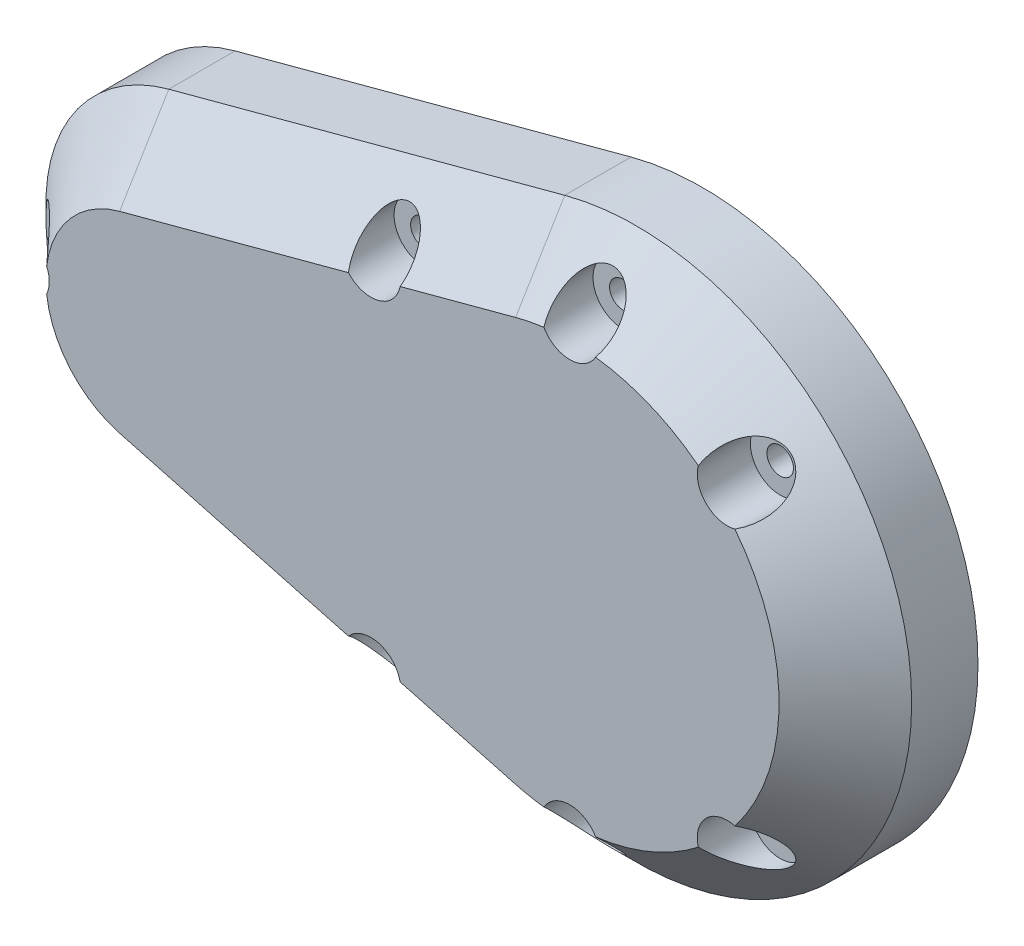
ISO-10303-21;
HEADER;
FILE_DESCRIPTION(('STEP AP214'),'2;1');
FILE_NAME('part.step','',(''),(''),'','','');
FILE_SCHEMA(('AUTOMOTIVE_DESIGN { 1 0 10303 214 1 1 1 1 }'));
ENDSEC;
DATA;
#1=APPLICATION_CONTEXT('core data for automotive mechanical design processes');
#2=APPLICATION_PROTOCOL_DEFINITION('international standard','automotive_design',2000,#1);
#3=PRODUCT_CONTEXT('',#1,'mechanical');
#4=PRODUCT('Part','Part','',(#3));
#5=PRODUCT_RELATED_PRODUCT_CATEGORY('part','',(#4));
#6=PRODUCT_DEFINITION_FORMATION('','',#4);
#7=PRODUCT_DEFINITION_CONTEXT('part definition',#1,'design');
#8=PRODUCT_DEFINITION('design','',#6,#7);
#9=PRODUCT_DEFINITION_SHAPE('','',#8);
#10=(LENGTH_UNIT() NAMED_UNIT(*) SI_UNIT(.MILLI.,.METRE.));
#11=(NAMED_UNIT(*) PLANE_ANGLE_UNIT() SI_UNIT($,.RADIAN.));
#12=(NAMED_UNIT(*) SI_UNIT($,.STERADIAN.) SOLID_ANGLE_UNIT());
#13=UNCERTAINTY_MEASURE_WITH_UNIT(LENGTH_MEASURE(1.E-05),#10,'distance_accuracy_value','');
#14=(GEOMETRIC_REPRESENTATION_CONTEXT(3) GLOBAL_UNCERTAINTY_ASSIGNED_CONTEXT((#13)) GLOBAL_UNIT_ASSIGNED_CONTEXT((#10,
#11,#12)) REPRESENTATION_CONTEXT('',''));
#15=CARTESIAN_POINT('',(0.,0.,0.));
#16=DIRECTION('',(0.,0.,1.));
#17=DIRECTION('',(1.,0.,0.));
#18=AXIS2_PLACEMENT_3D('',#15,#16,#17);
#19=CARTESIAN_POINT('',(-3.40000000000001,-13.3549838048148,10.));
#20=DIRECTION('',(0.,0.,-1.));
#21=DIRECTION('',(-1.,0.,0.));
#22=AXIS2_PLACEMENT_3D('',#19,#20,#21);
#23=CYLINDRICAL_SURFACE('',#22,0.999999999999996);
#24=CARTESIAN_POINT('',(-3.40000000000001,-13.3549838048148,0.));
#25=DIRECTION('',(0.,0.,-1.));
#26=DIRECTION('',(-1.,0.,0.));
#27=AXIS2_PLACEMENT_3D('',#24,#25,#26);
#28=CIRCLE('',#27,0.999999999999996);
#29=CARTESIAN_POINT('',(-4.40000000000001,-13.3549838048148,0.));
#30=VERTEX_POINT('',#29);
#31=EDGE_CURVE('E206',#30,#30,#28,.T.);
#32=ORIENTED_EDGE('',*,*,#31,.T.);
#33=EDGE_LOOP('',(#32));
#34=FACE_BOUND('',#33,.T.);
#35=CARTESIAN_POINT('',(-3.40000000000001,-13.3549838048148,6.));
#36=DIRECTION('',(0.,0.,1.));
#37=DIRECTION('',(1.,0.,0.));
#38=AXIS2_PLACEMENT_3D('',#35,#36,#37);
#39=CIRCLE('',#38,0.999999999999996);
#40=CARTESIAN_POINT('',(-2.40000000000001,-13.3549838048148,6.));
#41=VERTEX_POINT('',#40);
#42=EDGE_CURVE('E233',#41,#41,#39,.F.);
#43=ORIENTED_EDGE('',*,*,#42,.F.);
#44=EDGE_LOOP('',(#43));
#45=FACE_BOUND('',#44,.T.);
#46=ADVANCED_FACE('F59',(#34,#45),#23,.F.);
#47=CARTESIAN_POINT('',(23.4668141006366,11.8668141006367,10.));
#48=DIRECTION('',(0.,0.,-1.));
#49=DIRECTION('',(-1.,0.,0.));
#50=AXIS2_PLACEMENT_3D('',#47,#48,#49);
#51=CYLINDRICAL_SURFACE('',#50,0.999999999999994);
#52=CARTESIAN_POINT('',(23.4668141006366,11.8668141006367,0.));
#53=DIRECTION('',(0.,0.,-1.));
#54=DIRECTION('',(-1.,0.,0.));
#55=AXIS2_PLACEMENT_3D('',#52,#53,#54);
#56=CIRCLE('',#55,0.999999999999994);
#57=CARTESIAN_POINT('',(22.4668141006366,11.8668141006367,0.));
#58=VERTEX_POINT('',#57);
#59=EDGE_CURVE('E448',#58,#58,#56,.T.);
#60=ORIENTED_EDGE('',*,*,#59,.T.);
#61=EDGE_LOOP('',(#60));
#62=FACE_BOUND('',#61,.T.);
#63=CARTESIAN_POINT('',(23.4668141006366,11.8668141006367,6.));
#64=DIRECTION('',(0.,0.,1.));
#65=DIRECTION('',(1.,0.,0.));
#66=AXIS2_PLACEMENT_3D('',#63,#64,#65);
#67=CIRCLE('',#66,0.999999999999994);
#68=CARTESIAN_POINT('',(24.4668141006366,11.8668141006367,6.));
#69=VERTEX_POINT('',#68);
#70=EDGE_CURVE('E230',#69,#69,#67,.F.);
#71=ORIENTED_EDGE('',*,*,#70,.F.);
#72=EDGE_LOOP('',(#71));
#73=FACE_BOUND('',#72,.T.);
#74=ADVANCED_FACE('F343',(#62,#73),#51,.F.);
#75=CARTESIAN_POINT('',(11.6000000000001,16.7822094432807,10.));
#76=DIRECTION('',(0.,0.,-1.));
#77=DIRECTION('',(-1.,0.,0.));
#78=AXIS2_PLACEMENT_3D('',#75,#76,#77);
#79=CYLINDRICAL_SURFACE('',#78,1.);
#80=CARTESIAN_POINT('',(11.6000000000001,16.7822094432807,0.));
#81=DIRECTION('',(0.,0.,-1.));
#82=DIRECTION('',(-1.,0.,0.));
#83=AXIS2_PLACEMENT_3D('',#80,#81,#82);
#84=CIRCLE('',#83,1.);
#85=CARTESIAN_POINT('',(10.6000000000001,16.7822094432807,0.));
#86=VERTEX_POINT('',#85);
#87=EDGE_CURVE('E449',#86,#86,#84,.T.);
#88=ORIENTED_EDGE('',*,*,#87,.T.);
#89=EDGE_LOOP('',(#88));
#90=FACE_BOUND('',#89,.T.);
#91=CARTESIAN_POINT('',(11.6000000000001,16.7822094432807,6.));
#92=DIRECTION('',(0.,0.,1.));
#93=DIRECTION('',(1.,0.,0.));
#94=AXIS2_PLACEMENT_3D('',#91,#92,#93);
#95=CIRCLE('',#94,1.);
#96=CARTESIAN_POINT('',(12.6000000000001,16.7822094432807,6.));
#97=VERTEX_POINT('',#96);
#98=EDGE_CURVE('E227',#97,#97,#95,.F.);
#99=ORIENTED_EDGE('',*,*,#98,.F.);
#100=EDGE_LOOP('',(#99));
#101=FACE_BOUND('',#100,.T.);
#102=ADVANCED_FACE('F349',(#90,#101),#79,.F.);
#103=CARTESIAN_POINT('',(23.4668141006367,-11.8668141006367,10.));
#104=DIRECTION('',(0.,0.,-1.));
#105=DIRECTION('',(-1.,0.,0.));
#106=AXIS2_PLACEMENT_3D('',#103,#104,#105);
#107=CYLINDRICAL_SURFACE('',#106,1.);
#108=CARTESIAN_POINT('',(23.4668141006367,-11.8668141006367,0.));
#109=DIRECTION('',(0.,0.,-1.));
#110=DIRECTION('',(-1.,0.,0.));
#111=AXIS2_PLACEMENT_3D('',#108,#109,#110);
#112=CIRCLE('',#111,1.);
#113=CARTESIAN_POINT('',(22.4668141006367,-11.8668141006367,0.));
#114=VERTEX_POINT('',#113);
#115=EDGE_CURVE('E445',#114,#114,#112,.T.);
#116=ORIENTED_EDGE('',*,*,#115,.T.);
#117=EDGE_LOOP('',(#116));
#118=FACE_BOUND('',#117,.T.);
#119=CARTESIAN_POINT('',(23.4668141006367,-11.8668141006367,6.));
#120=DIRECTION('',(0.,0.,1.));
#121=DIRECTION('',(1.,0.,0.));
#122=AXIS2_PLACEMENT_3D('',#119,#120,#121);
#123=CIRCLE('',#122,1.);
#124=CARTESIAN_POINT('',(24.4668141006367,-11.8668141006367,6.));
#125=VERTEX_POINT('',#124);
#126=EDGE_CURVE('E224',#125,#125,#123,.F.);
#127=ORIENTED_EDGE('',*,*,#126,.F.);
#128=EDGE_LOOP('',(#127));
#129=FACE_BOUND('',#128,.T.);
#130=ADVANCED_FACE('F490',(#118,#129),#107,.F.);
#131=CARTESIAN_POINT('',(11.6,-16.7822094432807,10.));
#132=DIRECTION('',(0.,0.,-1.));
#133=DIRECTION('',(-1.,0.,0.));
#134=AXIS2_PLACEMENT_3D('',#131,#132,#133);
#135=CYLINDRICAL_SURFACE('',#134,1.);
#136=CARTESIAN_POINT('',(11.6,-16.7822094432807,0.));
#137=DIRECTION('',(0.,0.,-1.));
#138=DIRECTION('',(-1.,0.,0.));
#139=AXIS2_PLACEMENT_3D('',#136,#137,#138);
#140=CIRCLE('',#139,1.);
#141=CARTESIAN_POINT('',(10.6,-16.7822094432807,0.));
#142=VERTEX_POINT('',#141);
#143=EDGE_CURVE('E236',#142,#142,#140,.T.);
#144=ORIENTED_EDGE('',*,*,#143,.T.);
#145=EDGE_LOOP('',(#144));
#146=FACE_BOUND('',#145,.T.);
#147=CARTESIAN_POINT('',(11.6,-16.7822094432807,6.));
#148=DIRECTION('',(0.,0.,1.));
#149=DIRECTION('',(1.,0.,0.));
#150=AXIS2_PLACEMENT_3D('',#147,#148,#149);
#151=CIRCLE('',#150,1.);
#152=CARTESIAN_POINT('',(12.6,-16.7822094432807,6.));
#153=VERTEX_POINT('',#152);
#154=EDGE_CURVE('E221',#153,#153,#151,.F.);
#155=ORIENTED_EDGE('',*,*,#154,.F.);
#156=EDGE_LOOP('',(#155));
#157=FACE_BOUND('',#156,.T.);
#158=ADVANCED_FACE('F356',(#146,#157),#135,.F.);
#159=CARTESIAN_POINT('',(-29.9,0.,10.));
#160=DIRECTION('',(0.,0.,-1.));
#161=DIRECTION('',(-1.,0.,0.));
#162=AXIS2_PLACEMENT_3D('',#159,#160,#161);
#163=CYLINDRICAL_SURFACE('',#162,1.);
#164=CARTESIAN_POINT('',(-29.9,0.,0.));
#165=DIRECTION('',(0.,0.,-1.));
#166=DIRECTION('',(-1.,0.,0.));
#167=AXIS2_PLACEMENT_3D('',#164,#165,#166);
#168=CIRCLE('',#167,1.);
#169=CARTESIAN_POINT('',(-30.9,0.,0.));
#170=VERTEX_POINT('',#169);
#171=EDGE_CURVE('E442',#170,#170,#168,.T.);
#172=ORIENTED_EDGE('',*,*,#171,.T.);
#173=EDGE_LOOP('',(#172));
#174=FACE_BOUND('',#173,.T.);
#175=CARTESIAN_POINT('',(-29.9,0.,6.));
#176=DIRECTION('',(0.,0.,1.));
#177=DIRECTION('',(1.,0.,0.));
#178=AXIS2_PLACEMENT_3D('',#175,#176,#177);
#179=CIRCLE('',#178,1.);
#180=CARTESIAN_POINT('',(-28.9,0.,6.));
#181=VERTEX_POINT('',#180);
#182=EDGE_CURVE('E216',#181,#181,#179,.F.);
#183=ORIENTED_EDGE('',*,*,#182,.F.);
#184=EDGE_LOOP('',(#183));
#185=FACE_BOUND('',#184,.T.);
#186=ADVANCED_FACE('F489',(#174,#185),#163,.F.);
#187=CARTESIAN_POINT('',(-3.40000000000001,13.3549838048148,10.));
#188=DIRECTION('',(0.,0.,-1.));
#189=DIRECTION('',(-1.,0.,0.));
#190=AXIS2_PLACEMENT_3D('',#187,#188,#189);
#191=CYLINDRICAL_SURFACE('',#190,1.);
#192=CARTESIAN_POINT('',(-3.40000000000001,13.3549838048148,0.));
#193=DIRECTION('',(0.,0.,-1.));
#194=DIRECTION('',(-1.,0.,0.));
#195=AXIS2_PLACEMENT_3D('',#192,#193,#194);
#196=CIRCLE('',#195,1.);
#197=CARTESIAN_POINT('',(-4.40000000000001,13.3549838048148,0.));
#198=VERTEX_POINT('',#197);
#199=EDGE_CURVE('E452',#198,#198,#196,.T.);
#200=ORIENTED_EDGE('',*,*,#199,.T.);
#201=EDGE_LOOP('',(#200));
#202=FACE_BOUND('',#201,.T.);
#203=CARTESIAN_POINT('',(-3.40000000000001,13.3549838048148,6.));
#204=DIRECTION('',(0.,0.,1.));
#205=DIRECTION('',(1.,0.,0.));
#206=AXIS2_PLACEMENT_3D('',#203,#204,#205);
#207=CIRCLE('',#206,1.);
#208=CARTESIAN_POINT('',(-2.40000000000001,13.3549838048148,6.));
#209=VERTEX_POINT('',#208);
#210=EDGE_CURVE('E213',#209,#209,#207,.F.);
#211=ORIENTED_EDGE('',*,*,#210,.F.);
#212=EDGE_LOOP('',(#211));
#213=FACE_BOUND('',#212,.T.);
#214=ADVANCED_FACE('F377',(#202,#213),#191,.F.);
#215=CARTESIAN_POINT('',(11.6,0.,10.));
#216=DIRECTION('',(0.,0.,-1.));
#217=DIRECTION('',(-1.,0.,0.));
#218=AXIS2_PLACEMENT_3D('',#215,#216,#217);
#219=CYLINDRICAL_SURFACE('',#218,20.7822094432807);
#220=DIRECTION('',(0.,0.,-1.));
#221=VECTOR('',#220,1.);
#222=CARTESIAN_POINT('',(6.22116839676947,20.0740728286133,10.));
#223=LINE('',#222,#221);
#224=CARTESIAN_POINT('',(6.22116839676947,20.0740728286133,4.99999999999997));
#225=VERTEX_POINT('',#224);
#226=CARTESIAN_POINT('',(6.22116839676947,20.0740728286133,0.));
#227=VERTEX_POINT('',#226);
#228=EDGE_CURVE('E417',#225,#227,#223,.T.);
#229=ORIENTED_EDGE('',*,*,#228,.F.);
#230=CARTESIAN_POINT('',(11.6,0.,4.99999999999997));
#231=DIRECTION('',(0.,0.,1.));
#232=DIRECTION('',(1.,0.,0.));
#233=AXIS2_PLACEMENT_3D('',#230,#231,#232);
#234=CIRCLE('',#233,20.7822094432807);
#235=CARTESIAN_POINT('',(6.22116839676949,-20.0740728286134,4.99999999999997));
#236=VERTEX_POINT('',#235);
#237=EDGE_CURVE('E199',#225,#236,#234,.F.);
#238=ORIENTED_EDGE('',*,*,#237,.T.);
#239=DIRECTION('',(0.,0.,-1.));
#240=VECTOR('',#239,1.);
#241=CARTESIAN_POINT('',(6.22116839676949,-20.0740728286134,10.));
#242=LINE('',#241,#240);
#243=CARTESIAN_POINT('',(6.22116839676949,-20.0740728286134,0.));
#244=VERTEX_POINT('',#243);
#245=EDGE_CURVE('E429',#236,#244,#242,.T.);
#246=ORIENTED_EDGE('',*,*,#245,.T.);
#247=CARTESIAN_POINT('',(11.6,0.,0.));
#248=DIRECTION('',(0.,0.,1.));
#249=DIRECTION('',(1.,0.,0.));
#250=AXIS2_PLACEMENT_3D('',#247,#248,#249);
#251=CIRCLE('',#250,20.7822094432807);
#252=EDGE_CURVE('E212',#244,#227,#251,.T.);
#253=ORIENTED_EDGE('',*,*,#252,.T.);
#254=EDGE_LOOP('',(#229,#238,#246,#253));
#255=FACE_BOUND('',#254,.T.);
#256=ADVANCED_FACE('F374',(#255),#219,.T.);
#257=CARTESIAN_POINT('',(6.22116839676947,20.0740728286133,10.));
#258=DIRECTION('',(0.258819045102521,-0.965925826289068,0.));
#259=DIRECTION('',(0.965925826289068,0.258819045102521,0.));
#260=AXIS2_PLACEMENT_3D('',#257,#258,#259);
#261=PLANE('',#260);
#262=DIRECTION('',(0.,0.,-1.));
#263=VECTOR('',#262,1.);
#264=CARTESIAN_POINT('',(-23.6352380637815,12.0740728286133,10.));
#265=LINE('',#264,#263);
#266=CARTESIAN_POINT('',(-23.6352380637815,12.0740728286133,4.99999999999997));
#267=VERTEX_POINT('',#266);
#268=CARTESIAN_POINT('',(-23.6352380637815,12.0740728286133,0.));
#269=VERTEX_POINT('',#268);
#270=EDGE_CURVE('E421',#267,#269,#265,.T.);
#271=ORIENTED_EDGE('',*,*,#270,.F.);
#272=DIRECTION('',(0.965925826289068,0.258819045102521,0.));
#273=VECTOR('',#272,1.);
#274=CARTESIAN_POINT('',(6.22116839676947,20.0740728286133,4.99999999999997));
#275=LINE('',#274,#273);
#276=EDGE_CURVE('E197',#267,#225,#275,.T.);
#277=ORIENTED_EDGE('',*,*,#276,.T.);
#278=ORIENTED_EDGE('',*,*,#228,.T.);
#279=DIRECTION('',(-0.965925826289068,-0.258819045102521,0.));
#280=VECTOR('',#279,1.);
#281=CARTESIAN_POINT('',(6.22116839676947,20.0740728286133,0.));
#282=LINE('',#281,#280);
#283=EDGE_CURVE('E437',#227,#269,#282,.T.);
#284=ORIENTED_EDGE('',*,*,#283,.T.);
#285=EDGE_LOOP('',(#271,#277,#278,#284));
#286=FACE_BOUND('',#285,.T.);
#287=ADVANCED_FACE('F370',(#286),#261,.F.);
#288=CARTESIAN_POINT('',(-20.4,0.,10.));
#289=DIRECTION('',(0.,0.,-1.));
#290=DIRECTION('',(-1.,0.,0.));
#291=AXIS2_PLACEMENT_3D('',#288,#289,#290);
#292=CYLINDRICAL_SURFACE('',#291,12.5);
#293=DIRECTION('',(0.,0.,-1.));
#294=VECTOR('',#293,1.);
#295=CARTESIAN_POINT('',(-23.6352380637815,-12.0740728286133,10.));
#296=LINE('',#295,#294);
#297=CARTESIAN_POINT('',(-23.6352380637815,-12.0740728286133,4.99999999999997));
#298=VERTEX_POINT('',#297);
#299=CARTESIAN_POINT('',(-23.6352380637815,-12.0740728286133,0.));
#300=VERTEX_POINT('',#299);
#301=EDGE_CURVE('E425',#298,#300,#296,.T.);
#302=ORIENTED_EDGE('',*,*,#301,.F.);
#303=CARTESIAN_POINT('',(-20.4,0.,4.99999999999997));
#304=DIRECTION('',(0.,0.,1.));
#305=DIRECTION('',(1.,0.,0.));
#306=AXIS2_PLACEMENT_3D('',#303,#304,#305);
#307=CIRCLE('',#306,12.5);
#308=EDGE_CURVE('E195',#298,#267,#307,.F.);
#309=ORIENTED_EDGE('',*,*,#308,.T.);
#310=ORIENTED_EDGE('',*,*,#270,.T.);
#311=CARTESIAN_POINT('',(-20.4,0.,0.));
#312=DIRECTION('',(0.,0.,1.));
#313=DIRECTION('',(1.,0.,0.));
#314=AXIS2_PLACEMENT_3D('',#311,#312,#313);
#315=CIRCLE('',#314,12.5);
#316=EDGE_CURVE('E434',#269,#300,#315,.T.);
#317=ORIENTED_EDGE('',*,*,#316,.T.);
#318=EDGE_LOOP('',(#302,#309,#310,#317));
#319=FACE_BOUND('',#318,.T.);
#320=ADVANCED_FACE('F366',(#319),#292,.T.);
#321=CARTESIAN_POINT('',(6.22116839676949,-20.0740728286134,10.));
#322=DIRECTION('',(0.258819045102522,0.965925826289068,0.));
#323=DIRECTION('',(-0.965925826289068,0.258819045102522,0.));
#324=AXIS2_PLACEMENT_3D('',#321,#322,#323);
#325=PLANE('',#324);
#326=ORIENTED_EDGE('',*,*,#245,.F.);
#327=DIRECTION('',(-0.965925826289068,0.258819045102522,0.));
#328=VECTOR('',#327,1.);
#329=CARTESIAN_POINT('',(-23.6352380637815,-12.0740728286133,4.99999999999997));
#330=LINE('',#329,#328);
#331=EDGE_CURVE('E192',#236,#298,#330,.T.);
#332=ORIENTED_EDGE('',*,*,#331,.T.);
#333=ORIENTED_EDGE('',*,*,#301,.T.);
#334=DIRECTION('',(0.965925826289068,-0.258819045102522,0.));
#335=VECTOR('',#334,1.);
#336=CARTESIAN_POINT('',(6.22116839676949,-20.0740728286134,0.));
#337=LINE('',#336,#335);
#338=EDGE_CURVE('E431',#300,#244,#337,.T.);
#339=ORIENTED_EDGE('',*,*,#338,.T.);
#340=EDGE_LOOP('',(#326,#332,#333,#339));
#341=FACE_BOUND('',#340,.T.);
#342=ADVANCED_FACE('F360',(#341),#325,.F.);
#343=CARTESIAN_POINT('',(11.6,0.,10.));
#344=DIRECTION('',(0.,0.,1.));
#345=DIRECTION('',(1.,0.,0.));
#346=AXIS2_PLACEMENT_3D('',#343,#344,#345);
#347=PLANE('',#346);
#348=CARTESIAN_POINT('',(-29.9,0.,10.));
#349=DIRECTION('',(0.,0.,1.));
#350=DIRECTION('',(1.,0.,0.));
#351=AXIS2_PLACEMENT_3D('',#348,#349,#350);
#352=CIRCLE('',#351,2.25);
#353=CARTESIAN_POINT('',(-27.8440789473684,-0.914160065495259,10.));
#354=VERTEX_POINT('',#353);
#355=CARTESIAN_POINT('',(-27.8440789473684,0.914160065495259,10.));
#356=VERTEX_POINT('',#355);
#357=EDGE_CURVE('E394',#354,#356,#352,.T.);
#358=ORIENTED_EDGE('',*,*,#357,.F.);
#359=CARTESIAN_POINT('',(-20.4,0.,10.));
#360=DIRECTION('',(0.,0.,1.));
#361=DIRECTION('',(1.,0.,0.));
#362=AXIS2_PLACEMENT_3D('',#359,#360,#361);
#363=CIRCLE('',#362,7.49999999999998);
#364=CARTESIAN_POINT('',(-22.3411428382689,-7.24444369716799,10.));
#365=VERTEX_POINT('',#364);
#366=EDGE_CURVE('E179',#354,#365,#363,.T.);
#367=ORIENTED_EDGE('',*,*,#366,.T.);
#368=DIRECTION('',(0.965925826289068,-0.258819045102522,0.));
#369=VECTOR('',#368,1.);
#370=CARTESIAN_POINT('',(7.51526362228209,-15.244443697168,10.));
#371=LINE('',#370,#369);
#372=CARTESIAN_POINT('',(-5.08806669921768,-11.8673915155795,10.));
#373=VERTEX_POINT('',#372);
#374=EDGE_CURVE('E189',#365,#373,#371,.T.);
#375=ORIENTED_EDGE('',*,*,#374,.T.);
#376=CARTESIAN_POINT('',(-3.40000000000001,-13.3549838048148,10.));
#377=DIRECTION('',(0.,0.,1.));
#378=DIRECTION('',(1.,0.,0.));
#379=AXIS2_PLACEMENT_3D('',#376,#377,#378);
#380=CIRCLE('',#379,2.25);
#381=CARTESIAN_POINT('',(-1.1942952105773,-12.910724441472,10.));
#382=VERTEX_POINT('',#381);
#383=EDGE_CURVE('E391',#382,#373,#380,.T.);
#384=ORIENTED_EDGE('',*,*,#383,.F.);
#385=CARTESIAN_POINT('',(7.51526362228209,-15.244443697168,10.));
#386=VERTEX_POINT('',#385);
#387=EDGE_CURVE('E188',#382,#386,#371,.T.);
#388=ORIENTED_EDGE('',*,*,#387,.T.);
#389=CARTESIAN_POINT('',(11.6,0.,10.));
#390=DIRECTION('',(0.,0.,1.));
#391=DIRECTION('',(1.,0.,0.));
#392=AXIS2_PLACEMENT_3D('',#389,#390,#391);
#393=CIRCLE('',#392,15.7822094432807);
#394=CARTESIAN_POINT('',(9.64915954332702,-15.6611735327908,10.));
#395=VERTEX_POINT('',#394);
#396=EDGE_CURVE('E177',#386,#395,#393,.T.);
#397=ORIENTED_EDGE('',*,*,#396,.T.);
#398=CARTESIAN_POINT('',(11.6,-16.7822094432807,10.));
#399=DIRECTION('',(0.,0.,1.));
#400=DIRECTION('',(1.,0.,0.));
#401=AXIS2_PLACEMENT_3D('',#398,#399,#400);
#402=CIRCLE('',#401,2.25);
#403=CARTESIAN_POINT('',(13.550840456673,-15.6611735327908,10.));
#404=VERTEX_POINT('',#403);
#405=EDGE_CURVE('E408',#404,#395,#402,.T.);
#406=ORIENTED_EDGE('',*,*,#405,.F.);
#407=CARTESIAN_POINT('',(21.2946694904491,-12.4535745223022,10.));
#408=VERTEX_POINT('',#407);
#409=EDGE_CURVE('E181',#404,#408,#393,.T.);
#410=ORIENTED_EDGE('',*,*,#409,.T.);
#411=CARTESIAN_POINT('',(23.4668141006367,-11.8668141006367,10.));
#412=DIRECTION('',(0.,0.,1.));
#413=DIRECTION('',(1.,0.,0.));
#414=AXIS2_PLACEMENT_3D('',#411,#412,#413);
#415=CIRCLE('',#414,2.25);
#416=CARTESIAN_POINT('',(24.0535745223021,-9.69466949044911,10.));
#417=VERTEX_POINT('',#416);
#418=EDGE_CURVE('E480',#417,#408,#415,.T.);
#419=ORIENTED_EDGE('',*,*,#418,.F.);
#420=CARTESIAN_POINT('',(24.0535745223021,9.69466949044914,10.));
#421=VERTEX_POINT('',#420);
#422=EDGE_CURVE('E183',#417,#421,#393,.T.);
#423=ORIENTED_EDGE('',*,*,#422,.T.);
#424=CARTESIAN_POINT('',(23.4668141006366,11.8668141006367,10.));
#425=DIRECTION('',(0.,0.,1.));
#426=DIRECTION('',(1.,0.,0.));
#427=AXIS2_PLACEMENT_3D('',#424,#425,#426);
#428=CIRCLE('',#427,2.25);
#429=CARTESIAN_POINT('',(21.294669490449,12.4535745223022,10.));
#430=VERTEX_POINT('',#429);
#431=EDGE_CURVE('E475',#430,#421,#428,.T.);
#432=ORIENTED_EDGE('',*,*,#431,.F.);
#433=CARTESIAN_POINT('',(13.550840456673,15.6611735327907,10.));
#434=VERTEX_POINT('',#433);
#435=EDGE_CURVE('E416',#430,#434,#393,.T.);
#436=ORIENTED_EDGE('',*,*,#435,.T.);
#437=CARTESIAN_POINT('',(11.6,16.7822094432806,10.));
#438=DIRECTION('',(0.,0.,1.));
#439=DIRECTION('',(1.,0.,0.));
#440=AXIS2_PLACEMENT_3D('',#437,#438,#439);
#441=CIRCLE('',#440,2.25);
#442=CARTESIAN_POINT('',(9.64915954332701,15.6611735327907,10.));
#443=VERTEX_POINT('',#442);
#444=EDGE_CURVE('E470',#443,#434,#441,.T.);
#445=ORIENTED_EDGE('',*,*,#444,.F.);
#446=CARTESIAN_POINT('',(7.51526362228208,15.244443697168,10.));
#447=VERTEX_POINT('',#446);
#448=EDGE_CURVE('E414',#443,#447,#393,.T.);
#449=ORIENTED_EDGE('',*,*,#448,.T.);
#450=DIRECTION('',(-0.965925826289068,-0.258819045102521,0.));
#451=VECTOR('',#450,1.);
#452=CARTESIAN_POINT('',(-22.3411428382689,7.24444369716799,10.));
#453=LINE('',#452,#451);
#454=CARTESIAN_POINT('',(-1.19429521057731,12.910724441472,10.));
#455=VERTEX_POINT('',#454);
#456=EDGE_CURVE('E169',#447,#455,#453,.T.);
#457=ORIENTED_EDGE('',*,*,#456,.T.);
#458=CARTESIAN_POINT('',(-3.40000000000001,13.3549838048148,10.));
#459=DIRECTION('',(0.,0.,1.));
#460=DIRECTION('',(1.,0.,0.));
#461=AXIS2_PLACEMENT_3D('',#458,#459,#460);
#462=CIRCLE('',#461,2.25);
#463=CARTESIAN_POINT('',(-5.08806669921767,11.8673915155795,10.));
#464=VERTEX_POINT('',#463);
#465=EDGE_CURVE('E73',#464,#455,#462,.T.);
#466=ORIENTED_EDGE('',*,*,#465,.F.);
#467=CARTESIAN_POINT('',(-22.3411428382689,7.24444369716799,10.));
#468=VERTEX_POINT('',#467);
#469=EDGE_CURVE('E167',#464,#468,#453,.T.);
#470=ORIENTED_EDGE('',*,*,#469,.T.);
#471=EDGE_CURVE('E186',#468,#356,#363,.T.);
#472=ORIENTED_EDGE('',*,*,#471,.T.);
#473=EDGE_LOOP('',(#358,#367,#375,#384,#388,#397,#406,#410,#419,#423,#432,#436,#445,#449,#457,
#466,#470,#472));
#474=FACE_BOUND('',#473,.T.);
#475=ADVANCED_FACE('F165',(#474),#347,.T.);
#476=CARTESIAN_POINT('',(11.6,0.,0.));
#477=DIRECTION('',(0.,0.,1.));
#478=DIRECTION('',(1.,0.,0.));
#479=AXIS2_PLACEMENT_3D('',#476,#477,#478);
#480=PLANE('',#479);
#481=ORIENTED_EDGE('',*,*,#143,.F.);
#482=EDGE_LOOP('',(#481));
#483=FACE_BOUND('',#482,.T.);
#484=ORIENTED_EDGE('',*,*,#115,.F.);
#485=EDGE_LOOP('',(#484));
#486=FACE_BOUND('',#485,.T.);
#487=ORIENTED_EDGE('',*,*,#171,.F.);
#488=EDGE_LOOP('',(#487));
#489=FACE_BOUND('',#488,.T.);
#490=ORIENTED_EDGE('',*,*,#87,.F.);
#491=EDGE_LOOP('',(#490));
#492=FACE_BOUND('',#491,.T.);
#493=ORIENTED_EDGE('',*,*,#199,.F.);
#494=EDGE_LOOP('',(#493));
#495=FACE_BOUND('',#494,.T.);
#496=ORIENTED_EDGE('',*,*,#59,.F.);
#497=EDGE_LOOP('',(#496));
#498=FACE_BOUND('',#497,.T.);
#499=ORIENTED_EDGE('',*,*,#31,.F.);
#500=EDGE_LOOP('',(#499));
#501=FACE_BOUND('',#500,.T.);
#502=ORIENTED_EDGE('',*,*,#252,.F.);
#503=ORIENTED_EDGE('',*,*,#338,.F.);
#504=ORIENTED_EDGE('',*,*,#316,.F.);
#505=ORIENTED_EDGE('',*,*,#283,.F.);
#506=EDGE_LOOP('',(#502,#503,#504,#505));
#507=FACE_BOUND('',#506,.T.);
#508=ADVANCED_FACE('F340',(#483,#486,#489,#492,#495,#498,#501,#507),#480,.F.);
#509=CARTESIAN_POINT('',(7.51526362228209,15.244443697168,10.));
#510=DIRECTION('',(-0.18301270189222,0.683012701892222,0.707106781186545));
#511=DIRECTION('',(0.965925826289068,0.258819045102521,0.));
#512=AXIS2_PLACEMENT_3D('',#509,#510,#511);
#513=PLANE('',#512);
#514=CARTESIAN_POINT('',(-3.40000000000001,13.3549838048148,9.));
#515=DIRECTION('',(-0.18301270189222,0.683012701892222,0.707106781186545));
#516=DIRECTION('',(0.183012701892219,-0.683012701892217,0.70710678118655));
#517=AXIS2_PLACEMENT_3D('',#514,#515,#516);
#518=ELLIPSE('',#517,3.18198051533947,2.25);
#519=EDGE_CURVE('E12',#455,#464,#518,.T.);
#520=ORIENTED_EDGE('',*,*,#519,.F.);
#521=ORIENTED_EDGE('',*,*,#456,.F.);
#522=DIRECTION('',(0.183012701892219,-0.683012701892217,0.70710678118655));
#523=VECTOR('',#522,1.);
#524=CARTESIAN_POINT('',(6.22116839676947,20.0740728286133,4.99999999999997));
#525=LINE('',#524,#523);
#526=EDGE_CURVE('E208',#225,#447,#525,.T.);
#527=ORIENTED_EDGE('',*,*,#526,.F.);
#528=ORIENTED_EDGE('',*,*,#276,.F.);
#529=DIRECTION('',(-0.18301270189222,0.683012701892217,-0.70710678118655));
#530=VECTOR('',#529,1.);
#531=CARTESIAN_POINT('',(-22.3411428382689,7.24444369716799,10.));
#532=LINE('',#531,#530);
#533=EDGE_CURVE('E175',#468,#267,#532,.T.);
#534=ORIENTED_EDGE('',*,*,#533,.F.);
#535=ORIENTED_EDGE('',*,*,#469,.F.);
#536=EDGE_LOOP('',(#520,#521,#527,#528,#534,#535));
#537=FACE_BOUND('',#536,.T.);
#538=ADVANCED_FACE('F62',(#537),#513,.T.);
#539=CARTESIAN_POINT('',(-20.4,0.,10.));
#540=DIRECTION('',(0.,0.,-1.));
#541=DIRECTION('',(-1.,0.,0.));
#542=AXIS2_PLACEMENT_3D('',#539,#540,#541);
#543=CONICAL_SURFACE('',#542,7.49999999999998,0.785398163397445);
#544=CARTESIAN_POINT('',(-27.8439210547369,0.913804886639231,10.0001999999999));
#545=CARTESIAN_POINT('',(-27.8722468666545,0.977493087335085,9.9643115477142));
#546=CARTESIAN_POINT('',(-27.9028881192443,1.03850961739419,9.92576304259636));
#547=CARTESIAN_POINT('',(-27.9680446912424,1.15521574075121,9.84448164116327));
#548=CARTESIAN_POINT('',(-28.0025497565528,1.21091873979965,9.80175985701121));
#549=CARTESIAN_POINT('',(-28.0745284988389,1.31689732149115,9.71344199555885));
#550=CARTESIAN_POINT('',(-28.1119749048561,1.36721443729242,9.66787297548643));
#551=CARTESIAN_POINT('',(-28.1896498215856,1.46322200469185,9.57421664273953));
#552=CARTESIAN_POINT('',(-28.229880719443,1.50890840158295,9.5261271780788));
#553=CARTESIAN_POINT('',(-28.3285113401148,1.61238983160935,9.40933917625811));
#554=CARTESIAN_POINT('',(-28.3879955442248,1.66817022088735,9.33976657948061));
#555=CARTESIAN_POINT('',(-28.5107427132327,1.77169609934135,9.19809340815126));
#556=CARTESIAN_POINT('',(-28.5740061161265,1.81944065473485,9.12599254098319));
#557=CARTESIAN_POINT('',(-28.769217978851,1.95157068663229,8.90645575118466));
#558=CARTESIAN_POINT('',(-28.906129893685,2.02438738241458,8.75633097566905));
#559=CARTESIAN_POINT('',(-29.1933738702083,2.14194564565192,8.44953608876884));
#560=CARTESIAN_POINT('',(-29.3439758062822,2.1858358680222,8.29280088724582));
#561=CARTESIAN_POINT('',(-29.651992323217,2.24175182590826,7.98029896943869));
#562=CARTESIAN_POINT('',(-29.8094033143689,2.25379414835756,7.82453179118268));
#563=CARTESIAN_POINT('',(-30.058668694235,2.24621558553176,7.58360593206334));
#564=CARTESIAN_POINT('',(-30.1495264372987,2.23800780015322,7.49696018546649));
#565=CARTESIAN_POINT('',(-30.3313973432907,2.21017641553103,7.32569847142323));
#566=CARTESIAN_POINT('',(-30.4224105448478,2.19054937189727,7.24108312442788));
#567=CARTESIAN_POINT('',(-30.6940476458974,2.11359621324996,6.99158646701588));
#568=CARTESIAN_POINT('',(-30.8738206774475,2.03818944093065,6.83052339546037));
#569=CARTESIAN_POINT('',(-31.1482973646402,1.87573381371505,6.5895304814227));
#570=CARTESIAN_POINT('',(-31.2478490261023,1.80590958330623,6.50325609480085));
#571=CARTESIAN_POINT('',(-31.4382106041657,1.64672136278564,6.34002333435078));
#572=CARTESIAN_POINT('',(-31.5290528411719,1.55743398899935,6.26303022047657));
#573=CARTESIAN_POINT('',(-31.6554910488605,1.4088924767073,6.15680387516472));
#574=CARTESIAN_POINT('',(-31.6959711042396,1.35699094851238,6.12296237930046));
#575=CARTESIAN_POINT('',(-31.7731611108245,1.248286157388,6.05868921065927));
#576=CARTESIAN_POINT('',(-31.8098626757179,1.19147248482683,6.02826510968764));
#577=CARTESIAN_POINT('',(-31.8443210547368,1.13230545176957,5.9998));
#578=B_SPLINE_CURVE_WITH_KNOTS('',3,(#544,#545,#546,#547,#548,#549,#550,#551,#552,#553,#554,
#555,#556,#557,#558,#559,#560,#561,#562,#563,#564,#565,#566,#567,#568,#569,#570,#571,#572,#573,
#574,#575,#576,#577),.UNSPECIFIED.,.F.,.F.,(4,2,2,2,2,2,2,2,2,2,2,2,2,2,2,2,4),(0.,
0.234906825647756,0.469204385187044,0.701540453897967,0.934078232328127,1.25517347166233,
1.57630599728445,2.22109326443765,2.88409798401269,3.54675733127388,3.92370926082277,
4.30077494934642,5.05264220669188,5.49854849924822,5.94273020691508,6.16446628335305,
6.38668434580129),.UNSPECIFIED.);
#579=CARTESIAN_POINT('',(-31.8440789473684,1.13272108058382,6.));
#580=VERTEX_POINT('',#579);
#581=EDGE_CURVE('E68',#356,#580,#578,.T.);
#582=ORIENTED_EDGE('',*,*,#581,.F.);
#583=ORIENTED_EDGE('',*,*,#471,.F.);
#584=ORIENTED_EDGE('',*,*,#533,.T.);
#585=ORIENTED_EDGE('',*,*,#308,.F.);
#586=DIRECTION('',(-0.183012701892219,-0.683012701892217,-0.70710678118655));
#587=VECTOR('',#586,1.);
#588=CARTESIAN_POINT('',(-22.3411428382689,-7.24444369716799,10.));
#589=LINE('',#588,#587);
#590=EDGE_CURVE('E205',#365,#298,#589,.T.);
#591=ORIENTED_EDGE('',*,*,#590,.F.);
#592=ORIENTED_EDGE('',*,*,#366,.F.);
#593=CARTESIAN_POINT('',(-31.8443210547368,-1.13230545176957,5.9998));
#594=CARTESIAN_POINT('',(-31.7764167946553,-1.24887005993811,6.05587561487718));
#595=CARTESIAN_POINT('',(-31.7000487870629,-1.35598986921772,6.11938613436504));
#596=CARTESIAN_POINT('',(-31.5354626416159,-1.55042764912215,6.2576291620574));
#597=CARTESIAN_POINT('',(-31.4473566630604,-1.63791424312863,6.33225616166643));
#598=CARTESIAN_POINT('',(-31.2413558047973,-1.81261626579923,6.50874064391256));
#599=CARTESIAN_POINT('',(-31.1213241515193,-1.89494377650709,6.61287738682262));
#600=CARTESIAN_POINT('',(-30.8741781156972,-2.03313085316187,6.83070624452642));
#601=CARTESIAN_POINT('',(-30.7470355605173,-2.08887537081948,6.944437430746));
#602=CARTESIAN_POINT('',(-30.4546119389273,-2.1874304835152,7.21057234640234));
#603=CARTESIAN_POINT('',(-30.2885095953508,-2.22239804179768,7.36497125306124));
#604=CARTESIAN_POINT('',(-29.9583337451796,-2.25536155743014,7.6793266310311));
#605=CARTESIAN_POINT('',(-29.7942602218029,-2.25335782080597,7.83928305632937));
#606=CARTESIAN_POINT('',(-29.4701580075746,-2.21465698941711,8.16340410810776));
#607=CARTESIAN_POINT('',(-29.3102090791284,-2.17751151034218,8.32759640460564));
#608=CARTESIAN_POINT('',(-29.077980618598,-2.09607174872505,8.57246611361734));
#609=CARTESIAN_POINT('',(-29.0018014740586,-2.06460624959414,8.65391110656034));
#610=CARTESIAN_POINT('',(-28.8524805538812,-1.99300161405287,8.81575184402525));
#611=CARTESIAN_POINT('',(-28.7793379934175,-1.95286473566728,8.8961478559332));
#612=CARTESIAN_POINT('',(-28.6020349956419,-1.84212147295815,9.09374823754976));
#613=CARTESIAN_POINT('',(-28.500001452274,-1.76617130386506,9.2099289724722));
#614=CARTESIAN_POINT('',(-28.30647983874,-1.59371648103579,9.4347572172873));
#615=CARTESIAN_POINT('',(-28.2149453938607,-1.49730803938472,9.54343693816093));
#616=CARTESIAN_POINT('',(-28.0759667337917,-1.32027024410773,9.71153303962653));
#617=CARTESIAN_POINT('',(-28.024479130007,-1.24637161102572,9.77464423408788));
#618=CARTESIAN_POINT('',(-27.9525022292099,-1.12778825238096,9.86384028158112));
#619=CARTESIAN_POINT('',(-27.9293258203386,-1.08684035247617,9.89273673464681));
#620=CARTESIAN_POINT('',(-27.8850167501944,-1.00230656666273,9.94827195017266));
#621=CARTESIAN_POINT('',(-27.8638866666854,-0.958717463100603,9.97490785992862));
#622=CARTESIAN_POINT('',(-27.8439210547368,-0.913804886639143,10.0002));
#623=B_SPLINE_CURVE_WITH_KNOTS('',3,(#593,#594,#595,#596,#597,#598,#599,#600,#601,#602,#603,
#604,#605,#606,#607,#608,#609,#610,#611,#612,#613,#614,#615,#616,#617,#618,#619,#620,#621,#622),
.UNSPECIFIED.,.F.,.F.,(4,2,2,2,2,2,2,2,2,2,2,2,2,2,4),(0.,0.436448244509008,0.868990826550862,
1.4031050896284,1.93951042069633,2.62429326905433,3.30907044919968,4.00270445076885,
4.35002267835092,4.69725057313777,5.21258443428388,5.72554644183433,6.0546414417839,
6.22015755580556,6.38587953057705),.UNSPECIFIED.);
#624=CARTESIAN_POINT('',(-31.8440789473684,-1.13272108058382,6.));
#625=VERTEX_POINT('',#624);
#626=EDGE_CURVE('E296',#625,#354,#623,.T.);
#627=ORIENTED_EDGE('',*,*,#626,.F.);
#628=CARTESIAN_POINT('',(-20.4,0.,6.));
#629=DIRECTION('',(0.,0.,1.));
#630=DIRECTION('',(1.,0.,0.));
#631=AXIS2_PLACEMENT_3D('',#628,#629,#630);
#632=CIRCLE('',#631,11.5);
#633=EDGE_CURVE('E220',#625,#580,#632,.F.);
#634=ORIENTED_EDGE('',*,*,#633,.T.);
#635=EDGE_LOOP('',(#582,#583,#584,#585,#591,#592,#627,#634));
#636=FACE_BOUND('',#635,.T.);
#637=ADVANCED_FACE('F328',(#636),#543,.T.);
#638=CARTESIAN_POINT('',(11.6,0.,10.));
#639=DIRECTION('',(0.,0.,-1.));
#640=DIRECTION('',(-1.,0.,0.));
#641=AXIS2_PLACEMENT_3D('',#638,#639,#640);
#642=CONICAL_SURFACE('',#641,15.7822094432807,0.785398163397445);
#643=CARTESIAN_POINT('',(13.5507323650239,15.6609854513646,10.0001999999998));
#644=CARTESIAN_POINT('',(13.5950179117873,15.7381047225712,9.91818544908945));
#645=CARTESIAN_POINT('',(13.6342520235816,15.8168743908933,9.83507045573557));
#646=CARTESIAN_POINT('',(13.7028229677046,15.9770613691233,9.66738123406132));
#647=CARTESIAN_POINT('',(13.7321636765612,16.0584776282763,9.58280759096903));
#648=CARTESIAN_POINT('',(13.7813089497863,16.2237735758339,9.41245734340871));
#649=CARTESIAN_POINT('',(13.8010656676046,16.3076634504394,9.32667685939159));
#650=CARTESIAN_POINT('',(13.8308520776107,16.476944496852,9.15493058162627));
#651=CARTESIAN_POINT('',(13.8408804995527,16.5623358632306,9.06896476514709));
#652=CARTESIAN_POINT('',(13.8563354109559,16.8212585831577,8.8103070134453));
#653=CARTESIAN_POINT('',(13.8467881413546,16.9963777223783,8.63805121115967));
#654=CARTESIAN_POINT('',(13.7856050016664,17.3451455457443,8.29998568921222));
#655=CARTESIAN_POINT('',(13.7340560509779,17.5187965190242,8.13416339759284));
#656=CARTESIAN_POINT('',(13.607857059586,17.8056727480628,7.8638012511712));
#657=CARTESIAN_POINT('',(13.5451142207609,17.9211186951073,7.7560443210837));
#658=CARTESIAN_POINT('',(13.3958312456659,18.1443653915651,7.54939201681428));
#659=CARTESIAN_POINT('',(13.3093274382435,18.2521774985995,7.45048341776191));
#660=CARTESIAN_POINT('',(13.1339613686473,18.4318782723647,7.28679544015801));
#661=CARTESIAN_POINT('',(13.0501927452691,18.5063341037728,7.21939192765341));
#662=CARTESIAN_POINT('',(12.8676139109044,18.6446607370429,7.09475326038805));
#663=CARTESIAN_POINT('',(12.7688219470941,18.7085441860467,7.03750595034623));
#664=CARTESIAN_POINT('',(12.5766252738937,18.8115719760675,6.94551253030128));
#665=CARTESIAN_POINT('',(12.4855633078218,18.8531050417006,6.90856486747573));
#666=CARTESIAN_POINT('',(12.2954596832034,18.9244322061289,6.84524764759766));
#667=CARTESIAN_POINT('',(12.1964225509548,18.9542329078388,6.81887214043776));
#668=CARTESIAN_POINT('',(11.9921501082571,19.0002570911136,6.77818461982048));
#669=CARTESIAN_POINT('',(11.8868814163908,19.0163987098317,6.76394533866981));
#670=CARTESIAN_POINT('',(11.6741713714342,19.0335124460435,6.74884942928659));
#671=CARTESIAN_POINT('',(11.5667309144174,19.0344906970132,6.74798739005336));
#672=CARTESIAN_POINT('',(11.3642829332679,19.0218939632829,6.75909765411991));
#673=CARTESIAN_POINT('',(11.2691079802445,19.0097668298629,6.76979310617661));
#674=CARTESIAN_POINT('',(11.082733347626,18.9739989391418,6.80139171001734));
#675=CARTESIAN_POINT('',(10.9915337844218,18.9503578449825,6.8222951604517));
#676=CARTESIAN_POINT('',(10.812929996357,18.8922013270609,6.87384147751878));
#677=CARTESIAN_POINT('',(10.725676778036,18.8574298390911,6.90471385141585));
#678=CARTESIAN_POINT('',(10.5588282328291,18.7789515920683,6.97461078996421));
#679=CARTESIAN_POINT('',(10.4792371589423,18.7352399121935,7.01363984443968));
#680=CARTESIAN_POINT('',(10.2953526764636,18.6198122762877,7.11708629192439));
#681=CARTESIAN_POINT('',(10.195521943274,18.5442192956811,7.18513369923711));
#682=CARTESIAN_POINT('',(10.0136520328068,18.3824845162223,7.33166050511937));
#683=CARTESIAN_POINT('',(9.93164813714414,18.2963223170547,7.41016010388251));
#684=CARTESIAN_POINT('',(9.76040799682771,18.0869305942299,7.60229589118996));
#685=CARTESIAN_POINT('',(9.67790753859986,17.9609339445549,7.71890937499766));
#686=CARTESIAN_POINT('',(9.54145424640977,17.7021796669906,7.96092851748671));
#687=CARTESIAN_POINT('',(9.48754726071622,17.5694115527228,8.08634793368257));
#688=CARTESIAN_POINT('',(9.39527096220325,17.2651865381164,8.37697386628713));
#689=CARTESIAN_POINT('',(9.36492837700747,17.0928902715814,8.54384086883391));
#690=CARTESIAN_POINT('',(9.34367241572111,16.7496170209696,8.88133422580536));
#691=CARTESIAN_POINT('',(9.35276394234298,16.5786402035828,9.05196104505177));
#692=CARTESIAN_POINT('',(9.391760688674,16.3457324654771,9.28798802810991));
#693=CARTESIAN_POINT('',(9.40549611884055,16.2811874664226,9.35379315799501));
#694=CARTESIAN_POINT('',(9.43869561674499,16.1532162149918,9.48504540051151));
#695=CARTESIAN_POINT('',(9.45815831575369,16.0897896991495,9.55049259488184));
#696=CARTESIAN_POINT('',(9.50280161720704,15.9644837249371,9.68057036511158));
#697=CARTESIAN_POINT('',(9.52796725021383,15.9026006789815,9.74520261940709));
#698=CARTESIAN_POINT('',(9.58417734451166,15.7804787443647,9.87351102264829));
#699=CARTESIAN_POINT('',(9.61522435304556,15.7202405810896,9.93718674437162));
#700=CARTESIAN_POINT('',(9.64926763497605,15.6609854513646,10.0001999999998));
#701=B_SPLINE_CURVE_WITH_KNOTS('',3,(#643,#644,#645,#646,#647,#648,#649,#650,#651,#652,#653,
#654,#655,#656,#657,#658,#659,#660,#661,#662,#663,#664,#665,#666,#667,#668,#669,#670,#671,#672,
#673,#674,#675,#676,#677,#678,#679,#680,#681,#682,#683,#684,#685,#686,#687,#688,#689,#690,#691,
#692,#693,#694,#695,#696,#697,#698,#699,#700),.UNSPECIFIED.,.F.,.F.,(4,2,2,2,2,2,2,2,2,2,2,2,2,
2,2,2,2,2,2,2,2,2,2,2,2,2,2,2,4),(0.,0.362727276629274,0.725312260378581,1.08968922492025,
1.45411376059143,2.18800948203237,2.92039030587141,3.42850943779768,3.93585597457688,
4.32681236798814,4.71729764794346,5.03606873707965,5.35466016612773,5.67514774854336,
5.99550569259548,6.28377629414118,6.57205532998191,6.86751106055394,7.16312985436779,
7.58831649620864,8.01433712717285,8.58267879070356,9.15192902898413,9.87362063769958,
10.5954019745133,10.8748514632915,11.1542342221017,11.4328919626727,11.7116706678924),.UNSPECIFIED.);
#702=EDGE_CURVE('E290',#434,#443,#701,.T.);
#703=ORIENTED_EDGE('',*,*,#702,.F.);
#704=ORIENTED_EDGE('',*,*,#435,.F.);
#705=CARTESIAN_POINT('',(24.053365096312,9.69461292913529,10.0002));
#706=CARTESIAN_POINT('',(24.1392112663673,9.71782987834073,9.91818544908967));
#707=CARTESIAN_POINT('',(24.2226525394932,9.74578573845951,9.83507045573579));
#708=CARTESIAN_POINT('',(24.3844088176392,9.81056805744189,9.66738123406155));
#709=CARTESIAN_POINT('',(24.4627258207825,9.84739103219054,9.58280759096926));
#710=CARTESIAN_POINT('',(24.6143586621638,9.92952196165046,9.41245734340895));
#711=CARTESIAN_POINT('',(24.6876478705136,9.97487095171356,9.32667685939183));
#712=CARTESIAN_POINT('',(24.8284098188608,10.0735085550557,9.15493058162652));
#713=CARTESIAN_POINT('',(24.8958817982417,10.126798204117,9.06896476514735));
#714=CARTESIAN_POINT('',(25.0898960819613,10.2989559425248,8.81030701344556));
#715=CARTESIAN_POINT('',(25.2069730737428,10.4295348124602,8.63805121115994));
#716=CARTESIAN_POINT('',(25.4103261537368,10.7194139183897,8.29998568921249));
#717=CARTESIAN_POINT('',(25.4966653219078,10.8786543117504,8.13416339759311));
#718=CARTESIAN_POINT('',(25.6102812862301,11.1707426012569,7.86380125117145));
#719=CARTESIAN_POINT('',(25.6475480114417,11.2967411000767,7.75604432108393));
#720=CARTESIAN_POINT('',(25.6998482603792,11.5601593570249,7.54939201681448));
#721=CARTESIAN_POINT('',(25.7149155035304,11.6975614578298,7.45048341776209));
#722=CARTESIAN_POINT('',(25.7179806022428,11.9486316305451,7.28679544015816));
#723=CARTESIAN_POINT('',(25.7113954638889,12.0605132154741,7.21939192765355));
#724=CARTESIAN_POINT('',(25.6801044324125,12.2874276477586,7.09475326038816));
#725=CARTESIAN_POINT('',(25.6554203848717,12.4024565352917,7.03750595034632));
#726=CARTESIAN_POINT('',(25.5923684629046,12.6112117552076,6.94551253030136));
#727=CARTESIAN_POINT('',(25.5573462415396,12.7049706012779,6.9085648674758));
#728=CARTESIAN_POINT('',(25.4733586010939,12.8898300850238,6.84524764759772));
#729=CARTESIAN_POINT('',(25.4244010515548,12.9809321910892,6.81887214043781));
#730=CARTESIAN_POINT('',(25.3125026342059,13.1579186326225,6.77818461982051));
#731=CARTESIAN_POINT('',(25.2494802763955,13.2437686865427,6.76394533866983));
#732=CARTESIAN_POINT('',(25.111172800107,13.4062786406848,6.74884942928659));
#733=CARTESIAN_POINT('',(25.035892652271,13.4829422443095,6.74798739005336));
#734=CARTESIAN_POINT('',(24.8838330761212,13.6171873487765,6.75909765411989));
#735=CARTESIAN_POINT('',(24.8079590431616,13.6759110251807,6.76979310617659));
#736=CARTESIAN_POINT('',(24.6508805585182,13.7824060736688,6.8013917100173));
#737=CARTESIAN_POINT('',(24.5696759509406,13.830177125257,6.82229516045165));
#738=CARTESIAN_POINT('',(24.4022611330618,13.9153462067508,6.87384147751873));
#739=CARTESIAN_POINT('',(24.3159766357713,13.9524563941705,6.9047138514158));
#740=CARTESIAN_POINT('',(24.1425043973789,14.0149436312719,6.97461078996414));
#741=CARTESIAN_POINT('',(24.0553161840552,14.0403141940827,7.01363984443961));
#742=CARTESIAN_POINT('',(23.8436705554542,14.088720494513,7.1170862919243));
#743=CARTESIAN_POINT('',(23.719627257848,14.1058591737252,7.18513369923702));
#744=CARTESIAN_POINT('',(23.4766620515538,14.1200968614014,7.33166050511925));
#745=CARTESIAN_POINT('',(23.3577506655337,14.1171564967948,7.41016010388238));
#746=CARTESIAN_POINT('',(23.0886032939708,14.0901792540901,7.60229589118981));
#747=CARTESIAN_POINT('',(22.941173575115,14.0594228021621,7.7189093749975));
#748=CARTESIAN_POINT('',(22.6617196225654,13.9729429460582,7.96092851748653));
#749=CARTESIAN_POINT('',(22.529720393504,13.9171797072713,8.08634793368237));
#750=CARTESIAN_POINT('',(22.2493516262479,13.7673093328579,8.37697386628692));
#751=CARTESIAN_POINT('',(22.1060643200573,13.6669329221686,8.54384086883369));
#752=CARTESIAN_POINT('',(21.8483032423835,13.4392323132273,8.88133422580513));
#753=CARTESIAN_POINT('',(21.7338330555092,13.3119047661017,9.05196104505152));
#754=CARTESIAN_POINT('',(21.5967172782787,13.1196392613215,9.2879880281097));
#755=CARTESIAN_POINT('',(21.5607894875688,13.0642866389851,9.35379315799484));
#756=CARTESIAN_POINT('',(21.4937757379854,12.9503217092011,9.48504540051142));
#757=CARTESIAN_POINT('',(21.4626886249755,12.8917101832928,9.55049259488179));
#758=CARTESIAN_POINT('',(21.4056515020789,12.7715378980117,9.68057036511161));
#759=CARTESIAN_POINT('',(21.3796883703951,12.709985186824,9.74520261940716));
#760=CARTESIAN_POINT('',(21.3330816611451,12.5838853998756,9.87351102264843));
#761=CARTESIAN_POINT('',(21.3124403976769,12.5193370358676,9.9371867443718));
#762=CARTESIAN_POINT('',(21.2946129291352,12.4533650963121,10.0002));
#763=B_SPLINE_CURVE_WITH_KNOTS('',3,(#705,#706,#707,#708,#709,#710,#711,#712,#713,#714,#715,
#716,#717,#718,#719,#720,#721,#722,#723,#724,#725,#726,#727,#728,#729,#730,#731,#732,#733,#734,
#735,#736,#737,#738,#739,#740,#741,#742,#743,#744,#745,#746,#747,#748,#749,#750,#751,#752,#753,
#754,#755,#756,#757,#758,#759,#760,#761,#762),.UNSPECIFIED.,.F.,.F.,(4,2,2,2,2,2,2,2,2,2,2,2,2,
2,2,2,2,2,2,2,2,2,2,2,2,2,2,2,4),(0.,0.362727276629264,0.725312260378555,1.08968922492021,
1.45411376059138,2.1880094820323,2.92039030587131,3.42850943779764,3.9358559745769,
4.32681236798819,4.71729764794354,5.03606873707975,5.35466016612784,5.67514774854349,
5.99550569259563,6.28377629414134,6.57205532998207,6.86751106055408,7.16312985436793,
7.58831649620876,8.01433712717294,8.58267879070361,9.15192902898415,9.87362063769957,
10.5954019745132,10.8748514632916,11.154234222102,11.4328919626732,11.711670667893),.UNSPECIFIED.);
#764=EDGE_CURVE('E284',#421,#430,#763,.T.);
#765=ORIENTED_EDGE('',*,*,#764,.F.);
#766=ORIENTED_EDGE('',*,*,#422,.F.);
#767=CARTESIAN_POINT('',(21.2946129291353,-12.4533650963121,10.0002));
#768=CARTESIAN_POINT('',(21.3178298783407,-12.5392112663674,9.91818544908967));
#769=CARTESIAN_POINT('',(21.3457857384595,-12.6226525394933,9.83507045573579));
#770=CARTESIAN_POINT('',(21.4105680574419,-12.7844088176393,9.66738123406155));
#771=CARTESIAN_POINT('',(21.4473910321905,-12.8627258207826,9.58280759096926));
#772=CARTESIAN_POINT('',(21.5295219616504,-13.0143586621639,9.41245734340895));
#773=CARTESIAN_POINT('',(21.5748709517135,-13.0876478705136,9.32667685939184));
#774=CARTESIAN_POINT('',(21.6735085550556,-13.2284098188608,9.15493058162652));
#775=CARTESIAN_POINT('',(21.7267982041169,-13.2958817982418,9.06896476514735));
#776=CARTESIAN_POINT('',(21.8989559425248,-13.4898960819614,8.81030701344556));
#777=CARTESIAN_POINT('',(22.0295348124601,-13.6069730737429,8.63805121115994));
#778=CARTESIAN_POINT('',(22.3194139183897,-13.8103261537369,8.29998568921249));
#779=CARTESIAN_POINT('',(22.4786543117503,-13.8966653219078,8.13416339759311));
#780=CARTESIAN_POINT('',(22.7707426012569,-14.0102812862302,7.86380125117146));
#781=CARTESIAN_POINT('',(22.8967411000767,-14.0475480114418,7.75604432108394));
#782=CARTESIAN_POINT('',(23.1601593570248,-14.0998482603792,7.54939201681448));
#783=CARTESIAN_POINT('',(23.2975614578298,-14.1149155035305,7.45048341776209));
#784=CARTESIAN_POINT('',(23.5486316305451,-14.1179806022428,7.28679544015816));
#785=CARTESIAN_POINT('',(23.660513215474,-14.111395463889,7.21939192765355));
#786=CARTESIAN_POINT('',(23.8874276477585,-14.0801044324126,7.09475326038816));
#787=CARTESIAN_POINT('',(24.0024565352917,-14.0554203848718,7.03750595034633));
#788=CARTESIAN_POINT('',(24.2112117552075,-13.9923684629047,6.94551253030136));
#789=CARTESIAN_POINT('',(24.3049706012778,-13.9573462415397,6.9085648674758));
#790=CARTESIAN_POINT('',(24.4898300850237,-13.873358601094,6.84524764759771));
#791=CARTESIAN_POINT('',(24.5809321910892,-13.8244010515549,6.8188721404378));
#792=CARTESIAN_POINT('',(24.7579186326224,-13.712502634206,6.77818461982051));
#793=CARTESIAN_POINT('',(24.8437686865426,-13.6494802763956,6.76394533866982));
#794=CARTESIAN_POINT('',(25.0062786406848,-13.5111728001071,6.74884942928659));
#795=CARTESIAN_POINT('',(25.0829422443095,-13.4358926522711,6.74798739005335));
#796=CARTESIAN_POINT('',(25.2171873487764,-13.2838330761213,6.75909765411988));
#797=CARTESIAN_POINT('',(25.2759110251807,-13.2079590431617,6.76979310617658));
#798=CARTESIAN_POINT('',(25.3824060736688,-13.0508805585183,6.8013917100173));
#799=CARTESIAN_POINT('',(25.430177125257,-12.9696759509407,6.82229516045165));
#800=CARTESIAN_POINT('',(25.5153462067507,-12.8022611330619,6.87384147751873));
#801=CARTESIAN_POINT('',(25.5524563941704,-12.7159766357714,6.90471385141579));
#802=CARTESIAN_POINT('',(25.6149436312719,-12.542504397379,6.97461078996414));
#803=CARTESIAN_POINT('',(25.6403141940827,-12.4553161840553,7.0136398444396));
#804=CARTESIAN_POINT('',(25.688720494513,-12.2436705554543,7.1170862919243));
#805=CARTESIAN_POINT('',(25.7058591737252,-12.1196272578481,7.18513369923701));
#806=CARTESIAN_POINT('',(25.7200968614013,-11.8766620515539,7.33166050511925));
#807=CARTESIAN_POINT('',(25.7171564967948,-11.7577506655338,7.41016010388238));
#808=CARTESIAN_POINT('',(25.6901792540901,-11.4886032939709,7.60229589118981));
#809=CARTESIAN_POINT('',(25.6594228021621,-11.3411735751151,7.7189093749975));
#810=CARTESIAN_POINT('',(25.5729429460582,-11.0617196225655,7.96092851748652));
#811=CARTESIAN_POINT('',(25.5171797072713,-10.9297203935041,8.08634793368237));
#812=CARTESIAN_POINT('',(25.3673093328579,-10.649351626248,8.37697386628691));
#813=CARTESIAN_POINT('',(25.2669329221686,-10.5060643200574,8.54384086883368));
#814=CARTESIAN_POINT('',(25.0392323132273,-10.2483032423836,8.88133422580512));
#815=CARTESIAN_POINT('',(24.9119047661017,-10.1338330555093,9.05196104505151));
#816=CARTESIAN_POINT('',(24.7196392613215,-9.99671727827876,9.28798802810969));
#817=CARTESIAN_POINT('',(24.664286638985,-9.96078948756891,9.35379315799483));
#818=CARTESIAN_POINT('',(24.5503217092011,-9.89377573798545,9.48504540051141));
#819=CARTESIAN_POINT('',(24.4917101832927,-9.86268862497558,9.55049259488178));
#820=CARTESIAN_POINT('',(24.3715378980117,-9.80565150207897,9.68057036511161));
#821=CARTESIAN_POINT('',(24.309985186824,-9.77968837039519,9.74520261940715));
#822=CARTESIAN_POINT('',(24.1838853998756,-9.73308166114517,9.87351102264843));
#823=CARTESIAN_POINT('',(24.1193370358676,-9.71244039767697,9.9371867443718));
#824=CARTESIAN_POINT('',(24.0533650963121,-9.69461292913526,10.0002));
#825=B_SPLINE_CURVE_WITH_KNOTS('',3,(#767,#768,#769,#770,#771,#772,#773,#774,#775,#776,#777,
#778,#779,#780,#781,#782,#783,#784,#785,#786,#787,#788,#789,#790,#791,#792,#793,#794,#795,#796,
#797,#798,#799,#800,#801,#802,#803,#804,#805,#806,#807,#808,#809,#810,#811,#812,#813,#814,#815,
#816,#817,#818,#819,#820,#821,#822,#823,#824),.UNSPECIFIED.,.F.,.F.,(4,2,2,2,2,2,2,2,2,2,2,2,2,
2,2,2,2,2,2,2,2,2,2,2,2,2,2,2,4),(0.,0.362727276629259,0.72531226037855,1.0896892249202,
1.45411376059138,2.1880094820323,2.9203903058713,3.42850943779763,3.9358559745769,
4.32681236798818,4.71729764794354,5.03606873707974,5.35466016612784,5.67514774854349,
5.99550569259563,6.28377629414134,6.57205532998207,6.86751106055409,7.16312985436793,
7.58831649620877,8.01433712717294,8.58267879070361,9.15192902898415,9.87362063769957,
10.5954019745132,10.8748514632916,11.154234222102,11.4328919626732,11.7116706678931),.UNSPECIFIED.);
#826=EDGE_CURVE('E246',#408,#417,#825,.T.);
#827=ORIENTED_EDGE('',*,*,#826,.F.);
#828=ORIENTED_EDGE('',*,*,#409,.F.);
#829=CARTESIAN_POINT('',(9.649267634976,-15.6609854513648,10.0001999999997));
#830=CARTESIAN_POINT('',(9.60498208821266,-15.7381047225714,9.91818544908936));
#831=CARTESIAN_POINT('',(9.56574797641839,-15.8168743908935,9.83507045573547));
#832=CARTESIAN_POINT('',(9.49717703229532,-15.9770613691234,9.66738123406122));
#833=CARTESIAN_POINT('',(9.46783632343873,-16.0584776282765,9.58280759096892));
#834=CARTESIAN_POINT('',(9.4186910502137,-16.2237735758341,9.4124573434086));
#835=CARTESIAN_POINT('',(9.3989343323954,-16.3076634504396,9.32667685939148));
#836=CARTESIAN_POINT('',(9.36914792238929,-16.4769444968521,9.15493058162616));
#837=CARTESIAN_POINT('',(9.35911950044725,-16.5623358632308,9.06896476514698));
#838=CARTESIAN_POINT('',(9.34366458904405,-16.8212585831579,8.81030701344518));
#839=CARTESIAN_POINT('',(9.35321185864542,-16.9963777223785,8.63805121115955));
#840=CARTESIAN_POINT('',(9.41439499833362,-17.3451455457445,8.2999856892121));
#841=CARTESIAN_POINT('',(9.4659439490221,-17.5187965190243,8.13416339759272));
#842=CARTESIAN_POINT('',(9.59214294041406,-17.805672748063,7.86380125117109));
#843=CARTESIAN_POINT('',(9.65488577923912,-17.9211186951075,7.7560443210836));
#844=CARTESIAN_POINT('',(9.80416875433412,-18.1443653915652,7.54939201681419));
#845=CARTESIAN_POINT('',(9.89067256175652,-18.2521774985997,7.45048341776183));
#846=CARTESIAN_POINT('',(10.0660386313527,-18.4318782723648,7.28679544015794));
#847=CARTESIAN_POINT('',(10.1498072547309,-18.5063341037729,7.21939192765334));
#848=CARTESIAN_POINT('',(10.3323860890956,-18.6446607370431,7.09475326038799));
#849=CARTESIAN_POINT('',(10.4311780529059,-18.7085441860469,7.03750595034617));
#850=CARTESIAN_POINT('',(10.6233747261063,-18.8115719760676,6.94551253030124));
#851=CARTESIAN_POINT('',(10.7144366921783,-18.8531050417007,6.90856486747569));
#852=CARTESIAN_POINT('',(10.9045403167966,-18.924432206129,6.84524764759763));
#853=CARTESIAN_POINT('',(11.0035774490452,-18.9542329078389,6.81887214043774));
#854=CARTESIAN_POINT('',(11.2078498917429,-19.0002570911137,6.77818461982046));
#855=CARTESIAN_POINT('',(11.3131185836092,-19.0163987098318,6.76394533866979));
#856=CARTESIAN_POINT('',(11.5258286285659,-19.0335124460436,6.74884942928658));
#857=CARTESIAN_POINT('',(11.6332690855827,-19.0344906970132,6.74798739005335));
#858=CARTESIAN_POINT('',(11.8357170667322,-19.021893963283,6.7590976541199));
#859=CARTESIAN_POINT('',(11.9308920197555,-19.009766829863,6.76979310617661));
#860=CARTESIAN_POINT('',(12.1172666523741,-18.9739989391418,6.80139171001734));
#861=CARTESIAN_POINT('',(12.2084662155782,-18.9503578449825,6.8222951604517));
#862=CARTESIAN_POINT('',(12.3870700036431,-18.892201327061,6.87384147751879));
#863=CARTESIAN_POINT('',(12.4743232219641,-18.8574298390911,6.90471385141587));
#864=CARTESIAN_POINT('',(12.641171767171,-18.7789515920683,6.97461078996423));
#865=CARTESIAN_POINT('',(12.7207628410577,-18.7352399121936,7.0136398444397));
#866=CARTESIAN_POINT('',(12.9046473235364,-18.6198122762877,7.11708629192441));
#867=CARTESIAN_POINT('',(13.004478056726,-18.5442192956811,7.18513369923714));
#868=CARTESIAN_POINT('',(13.1863479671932,-18.3824845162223,7.3316605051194));
#869=CARTESIAN_POINT('',(13.2683518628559,-18.2963223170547,7.41016010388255));
#870=CARTESIAN_POINT('',(13.4395920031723,-18.0869305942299,7.60229589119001));
#871=CARTESIAN_POINT('',(13.5220924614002,-17.9609339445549,7.71890937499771));
#872=CARTESIAN_POINT('',(13.6585457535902,-17.7021796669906,7.96092851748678));
#873=CARTESIAN_POINT('',(13.7124527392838,-17.5694115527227,8.08634793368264));
#874=CARTESIAN_POINT('',(13.8047290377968,-17.2651865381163,8.37697386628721));
#875=CARTESIAN_POINT('',(13.8350716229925,-17.0928902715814,8.543840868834));
#876=CARTESIAN_POINT('',(13.8563275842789,-16.7496170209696,8.88133422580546));
#877=CARTESIAN_POINT('',(13.847236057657,-16.5786402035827,9.05196104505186));
#878=CARTESIAN_POINT('',(13.808239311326,-16.345732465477,9.28798802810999));
#879=CARTESIAN_POINT('',(13.7945038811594,-16.2811874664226,9.35379315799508));
#880=CARTESIAN_POINT('',(13.761304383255,-16.1532162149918,9.48504540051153));
#881=CARTESIAN_POINT('',(13.7418416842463,-16.0897896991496,9.55049259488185));
#882=CARTESIAN_POINT('',(13.6971983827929,-15.9644837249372,9.68057036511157));
#883=CARTESIAN_POINT('',(13.6720327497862,-15.9026006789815,9.74520261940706));
#884=CARTESIAN_POINT('',(13.6158226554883,-15.7804787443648,9.87351102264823));
#885=CARTESIAN_POINT('',(13.5847756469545,-15.7202405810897,9.93718674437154));
#886=CARTESIAN_POINT('',(13.550732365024,-15.6609854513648,10.0001999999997));
#887=B_SPLINE_CURVE_WITH_KNOTS('',3,(#829,#830,#831,#832,#833,#834,#835,#836,#837,#838,#839,
#840,#841,#842,#843,#844,#845,#846,#847,#848,#849,#850,#851,#852,#853,#854,#855,#856,#857,#858,
#859,#860,#861,#862,#863,#864,#865,#866,#867,#868,#869,#870,#871,#872,#873,#874,#875,#876,#877,
#878,#879,#880,#881,#882,#883,#884,#885,#886),.UNSPECIFIED.,.F.,.F.,(4,2,2,2,2,2,2,2,2,2,2,2,2,
2,2,2,2,2,2,2,2,2,2,2,2,2,2,2,4),(0.,0.36272727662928,0.725312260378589,1.08968922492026,
1.45411376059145,2.18800948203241,2.92039030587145,3.42850943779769,3.93585597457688,
4.32681236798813,4.71729764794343,5.03606873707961,5.35466016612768,5.67514774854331,
5.99550569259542,6.28377629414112,6.57205532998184,6.86751106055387,7.16312985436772,
7.58831649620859,8.01433712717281,8.58267879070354,9.15192902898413,9.87362063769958,
10.5954019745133,10.8748514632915,11.1542342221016,11.4328919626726,11.7116706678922),.UNSPECIFIED.);
#888=EDGE_CURVE('E238',#395,#404,#887,.T.);
#889=ORIENTED_EDGE('',*,*,#888,.F.);
#890=ORIENTED_EDGE('',*,*,#396,.F.);
#891=DIRECTION('',(0.183012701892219,0.683012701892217,0.70710678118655));
#892=VECTOR('',#891,1.);
#893=CARTESIAN_POINT('',(6.22116839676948,-20.0740728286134,4.99999999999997));
#894=LINE('',#893,#892);
#895=EDGE_CURVE('E202',#236,#386,#894,.T.);
#896=ORIENTED_EDGE('',*,*,#895,.F.);
#897=ORIENTED_EDGE('',*,*,#237,.F.);
#898=ORIENTED_EDGE('',*,*,#526,.T.);
#899=ORIENTED_EDGE('',*,*,#448,.F.);
#900=EDGE_LOOP('',(#703,#704,#765,#766,#827,#828,#889,#890,#896,#897,#898,#899));
#901=FACE_BOUND('',#900,.T.);
#902=ADVANCED_FACE('F254',(#901),#642,.T.);
#903=CARTESIAN_POINT('',(7.51526362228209,-15.244443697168,10.));
#904=DIRECTION('',(-0.183012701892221,-0.683012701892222,0.707106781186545));
#905=DIRECTION('',(-0.965925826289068,0.258819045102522,0.));
#906=AXIS2_PLACEMENT_3D('',#903,#904,#905);
#907=PLANE('',#906);
#908=CARTESIAN_POINT('',(-3.40000000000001,-13.3549838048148,9.00000000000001));
#909=DIRECTION('',(-0.183012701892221,-0.683012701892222,0.707106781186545));
#910=DIRECTION('',(0.183012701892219,0.683012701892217,0.70710678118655));
#911=AXIS2_PLACEMENT_3D('',#908,#909,#910);
#912=ELLIPSE('',#911,3.18198051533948,2.25);
#913=EDGE_CURVE('E201',#373,#382,#912,.T.);
#914=ORIENTED_EDGE('',*,*,#913,.F.);
#915=ORIENTED_EDGE('',*,*,#374,.F.);
#916=ORIENTED_EDGE('',*,*,#590,.T.);
#917=ORIENTED_EDGE('',*,*,#331,.F.);
#918=ORIENTED_EDGE('',*,*,#895,.T.);
#919=ORIENTED_EDGE('',*,*,#387,.F.);
#920=EDGE_LOOP('',(#914,#915,#916,#917,#918,#919));
#921=FACE_BOUND('',#920,.T.);
#922=ADVANCED_FACE('F315',(#921),#907,.T.);
#923=CARTESIAN_POINT('',(-3.40000000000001,13.3549838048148,6.));
#924=DIRECTION('',(0.,0.,1.));
#925=DIRECTION('',(1.,0.,0.));
#926=AXIS2_PLACEMENT_3D('',#923,#924,#925);
#927=PLANE('',#926);
#928=CARTESIAN_POINT('',(-3.40000000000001,13.3549838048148,6.));
#929=DIRECTION('',(0.,0.,1.));
#930=DIRECTION('',(1.,0.,0.));
#931=AXIS2_PLACEMENT_3D('',#928,#929,#930);
#932=CIRCLE('',#931,2.25);
#933=CARTESIAN_POINT('',(-1.15000000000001,13.3549838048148,6.));
#934=VERTEX_POINT('',#933);
#935=EDGE_CURVE('E171',#934,#934,#932,.T.);
#936=ORIENTED_EDGE('',*,*,#935,.T.);
#937=EDGE_LOOP('',(#936));
#938=FACE_BOUND('',#937,.T.);
#939=ORIENTED_EDGE('',*,*,#210,.T.);
#940=EDGE_LOOP('',(#939));
#941=FACE_BOUND('',#940,.T.);
#942=ADVANCED_FACE('F313',(#938,#941),#927,.T.);
#943=CARTESIAN_POINT('',(-3.40000000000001,13.3549838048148,6.));
#944=DIRECTION('',(0.,0.,1.));
#945=DIRECTION('',(1.,0.,0.));
#946=AXIS2_PLACEMENT_3D('',#943,#944,#945);
#947=CYLINDRICAL_SURFACE('',#946,2.25);
#948=ORIENTED_EDGE('',*,*,#519,.T.);
#949=ORIENTED_EDGE('',*,*,#465,.T.);
#950=EDGE_LOOP('',(#948,#949));
#951=FACE_BOUND('',#950,.T.);
#952=ORIENTED_EDGE('',*,*,#935,.F.);
#953=EDGE_LOOP('',(#952));
#954=FACE_BOUND('',#953,.T.);
#955=ADVANCED_FACE('F157',(#951,#954),#947,.F.);
#956=CARTESIAN_POINT('',(-29.9,0.,6.));
#957=DIRECTION('',(0.,0.,1.));
#958=DIRECTION('',(1.,0.,0.));
#959=AXIS2_PLACEMENT_3D('',#956,#957,#958);
#960=PLANE('',#959);
#961=CARTESIAN_POINT('',(-29.9,0.,6.));
#962=DIRECTION('',(0.,0.,1.));
#963=DIRECTION('',(1.,0.,0.));
#964=AXIS2_PLACEMENT_3D('',#961,#962,#963);
#965=CIRCLE('',#964,2.25);
#966=EDGE_CURVE('E80',#625,#580,#965,.T.);
#967=ORIENTED_EDGE('',*,*,#966,.T.);
#968=ORIENTED_EDGE('',*,*,#633,.F.);
#969=EDGE_LOOP('',(#967,#968));
#970=FACE_BOUND('',#969,.T.);
#971=ORIENTED_EDGE('',*,*,#182,.T.);
#972=EDGE_LOOP('',(#971));
#973=FACE_BOUND('',#972,.T.);
#974=ADVANCED_FACE('F312',(#970,#973),#960,.T.);
#975=CARTESIAN_POINT('',(-29.9,0.,6.));
#976=DIRECTION('',(0.,0.,1.));
#977=DIRECTION('',(1.,0.,0.));
#978=AXIS2_PLACEMENT_3D('',#975,#976,#977);
#979=CYLINDRICAL_SURFACE('',#978,2.25);
#980=ORIENTED_EDGE('',*,*,#581,.T.);
#981=ORIENTED_EDGE('',*,*,#966,.F.);
#982=ORIENTED_EDGE('',*,*,#626,.T.);
#983=ORIENTED_EDGE('',*,*,#357,.T.);
#984=EDGE_LOOP('',(#980,#981,#982,#983));
#985=FACE_BOUND('',#984,.T.);
#986=ADVANCED_FACE('F265',(#985),#979,.F.);
#987=CARTESIAN_POINT('',(11.6,-16.7822094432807,6.));
#988=DIRECTION('',(0.,0.,1.));
#989=DIRECTION('',(1.,0.,0.));
#990=AXIS2_PLACEMENT_3D('',#987,#988,#989);
#991=PLANE('',#990);
#992=CARTESIAN_POINT('',(11.6,-16.7822094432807,6.));
#993=DIRECTION('',(0.,0.,1.));
#994=DIRECTION('',(1.,0.,0.));
#995=AXIS2_PLACEMENT_3D('',#992,#993,#994);
#996=CIRCLE('',#995,2.25);
#997=CARTESIAN_POINT('',(13.85,-16.7822094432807,6.));
#998=VERTEX_POINT('',#997);
#999=EDGE_CURVE('E410',#998,#998,#996,.T.);
#1000=ORIENTED_EDGE('',*,*,#999,.T.);
#1001=EDGE_LOOP('',(#1000));
#1002=FACE_BOUND('',#1001,.T.);
#1003=ORIENTED_EDGE('',*,*,#154,.T.);
#1004=EDGE_LOOP('',(#1003));
#1005=FACE_BOUND('',#1004,.T.);
#1006=ADVANCED_FACE('F262',(#1002,#1005),#991,.T.);
#1007=CARTESIAN_POINT('',(11.6,-16.7822094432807,6.));
#1008=DIRECTION('',(0.,0.,1.));
#1009=DIRECTION('',(1.,0.,0.));
#1010=AXIS2_PLACEMENT_3D('',#1007,#1008,#1009);
#1011=CYLINDRICAL_SURFACE('',#1010,2.25);
#1012=ORIENTED_EDGE('',*,*,#888,.T.);
#1013=ORIENTED_EDGE('',*,*,#405,.T.);
#1014=EDGE_LOOP('',(#1012,#1013));
#1015=FACE_BOUND('',#1014,.T.);
#1016=ORIENTED_EDGE('',*,*,#999,.F.);
#1017=EDGE_LOOP('',(#1016));
#1018=FACE_BOUND('',#1017,.T.);
#1019=ADVANCED_FACE('F257',(#1015,#1018),#1011,.F.);
#1020=CARTESIAN_POINT('',(23.4668141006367,-11.8668141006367,6.));
#1021=DIRECTION('',(0.,0.,1.));
#1022=DIRECTION('',(1.,0.,0.));
#1023=AXIS2_PLACEMENT_3D('',#1020,#1021,#1022);
#1024=PLANE('',#1023);
#1025=CARTESIAN_POINT('',(23.4668141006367,-11.8668141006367,6.));
#1026=DIRECTION('',(0.,0.,1.));
#1027=DIRECTION('',(1.,0.,0.));
#1028=AXIS2_PLACEMENT_3D('',#1025,#1026,#1027);
#1029=CIRCLE('',#1028,2.25);
#1030=CARTESIAN_POINT('',(25.7168141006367,-11.8668141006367,6.));
#1031=VERTEX_POINT('',#1030);
#1032=EDGE_CURVE('E477',#1031,#1031,#1029,.T.);
#1033=ORIENTED_EDGE('',*,*,#1032,.T.);
#1034=EDGE_LOOP('',(#1033));
#1035=FACE_BOUND('',#1034,.T.);
#1036=ORIENTED_EDGE('',*,*,#126,.T.);
#1037=EDGE_LOOP('',(#1036));
#1038=FACE_BOUND('',#1037,.T.);
#1039=ADVANCED_FACE('F261',(#1035,#1038),#1024,.T.);
#1040=CARTESIAN_POINT('',(23.4668141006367,-11.8668141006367,6.));
#1041=DIRECTION('',(0.,0.,1.));
#1042=DIRECTION('',(1.,0.,0.));
#1043=AXIS2_PLACEMENT_3D('',#1040,#1041,#1042);
#1044=CYLINDRICAL_SURFACE('',#1043,2.25);
#1045=ORIENTED_EDGE('',*,*,#826,.T.);
#1046=ORIENTED_EDGE('',*,*,#418,.T.);
#1047=EDGE_LOOP('',(#1045,#1046));
#1048=FACE_BOUND('',#1047,.T.);
#1049=ORIENTED_EDGE('',*,*,#1032,.F.);
#1050=EDGE_LOOP('',(#1049));
#1051=FACE_BOUND('',#1050,.T.);
#1052=ADVANCED_FACE('F267',(#1048,#1051),#1044,.F.);
#1053=CARTESIAN_POINT('',(11.6,16.7822094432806,6.));
#1054=DIRECTION('',(0.,0.,1.));
#1055=DIRECTION('',(1.,0.,0.));
#1056=AXIS2_PLACEMENT_3D('',#1053,#1054,#1055);
#1057=PLANE('',#1056);
#1058=CARTESIAN_POINT('',(11.6,16.7822094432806,6.));
#1059=DIRECTION('',(0.,0.,1.));
#1060=DIRECTION('',(1.,0.,0.));
#1061=AXIS2_PLACEMENT_3D('',#1058,#1059,#1060);
#1062=CIRCLE('',#1061,2.25);
#1063=CARTESIAN_POINT('',(13.85,16.7822094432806,6.));
#1064=VERTEX_POINT('',#1063);
#1065=EDGE_CURVE('E170',#1064,#1064,#1062,.T.);
#1066=ORIENTED_EDGE('',*,*,#1065,.T.);
#1067=EDGE_LOOP('',(#1066));
#1068=FACE_BOUND('',#1067,.T.);
#1069=ORIENTED_EDGE('',*,*,#98,.T.);
#1070=EDGE_LOOP('',(#1069));
#1071=FACE_BOUND('',#1070,.T.);
#1072=ADVANCED_FACE('F271',(#1068,#1071),#1057,.T.);
#1073=CARTESIAN_POINT('',(11.6,16.7822094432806,6.));
#1074=DIRECTION('',(0.,0.,1.));
#1075=DIRECTION('',(1.,0.,0.));
#1076=AXIS2_PLACEMENT_3D('',#1073,#1074,#1075);
#1077=CYLINDRICAL_SURFACE('',#1076,2.25);
#1078=ORIENTED_EDGE('',*,*,#702,.T.);
#1079=ORIENTED_EDGE('',*,*,#444,.T.);
#1080=EDGE_LOOP('',(#1078,#1079));
#1081=FACE_BOUND('',#1080,.T.);
#1082=ORIENTED_EDGE('',*,*,#1065,.F.);
#1083=EDGE_LOOP('',(#1082));
#1084=FACE_BOUND('',#1083,.T.);
#1085=ADVANCED_FACE('F302',(#1081,#1084),#1077,.F.);
#1086=CARTESIAN_POINT('',(23.4668141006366,11.8668141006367,6.));
#1087=DIRECTION('',(0.,0.,1.));
#1088=DIRECTION('',(1.,0.,0.));
#1089=AXIS2_PLACEMENT_3D('',#1086,#1087,#1088);
#1090=PLANE('',#1089);
#1091=CARTESIAN_POINT('',(23.4668141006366,11.8668141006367,6.));
#1092=DIRECTION('',(0.,0.,1.));
#1093=DIRECTION('',(1.,0.,0.));
#1094=AXIS2_PLACEMENT_3D('',#1091,#1092,#1093);
#1095=CIRCLE('',#1094,2.25);
#1096=CARTESIAN_POINT('',(25.7168141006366,11.8668141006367,6.));
#1097=VERTEX_POINT('',#1096);
#1098=EDGE_CURVE('E472',#1097,#1097,#1095,.T.);
#1099=ORIENTED_EDGE('',*,*,#1098,.T.);
#1100=EDGE_LOOP('',(#1099));
#1101=FACE_BOUND('',#1100,.T.);
#1102=ORIENTED_EDGE('',*,*,#70,.T.);
#1103=EDGE_LOOP('',(#1102));
#1104=FACE_BOUND('',#1103,.T.);
#1105=ADVANCED_FACE('F281',(#1101,#1104),#1090,.T.);
#1106=CARTESIAN_POINT('',(23.4668141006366,11.8668141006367,6.));
#1107=DIRECTION('',(0.,0.,1.));
#1108=DIRECTION('',(1.,0.,0.));
#1109=AXIS2_PLACEMENT_3D('',#1106,#1107,#1108);
#1110=CYLINDRICAL_SURFACE('',#1109,2.25);
#1111=ORIENTED_EDGE('',*,*,#764,.T.);
#1112=ORIENTED_EDGE('',*,*,#431,.T.);
#1113=EDGE_LOOP('',(#1111,#1112));
#1114=FACE_BOUND('',#1113,.T.);
#1115=ORIENTED_EDGE('',*,*,#1098,.F.);
#1116=EDGE_LOOP('',(#1115));
#1117=FACE_BOUND('',#1116,.T.);
#1118=ADVANCED_FACE('F276',(#1114,#1117),#1110,.F.);
#1119=CARTESIAN_POINT('',(-3.40000000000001,-13.3549838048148,6.));
#1120=DIRECTION('',(0.,0.,1.));
#1121=DIRECTION('',(1.,0.,0.));
#1122=AXIS2_PLACEMENT_3D('',#1119,#1120,#1121);
#1123=PLANE('',#1122);
#1124=CARTESIAN_POINT('',(-3.40000000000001,-13.3549838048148,6.));
#1125=DIRECTION('',(0.,0.,1.));
#1126=DIRECTION('',(1.,0.,0.));
#1127=AXIS2_PLACEMENT_3D('',#1124,#1125,#1126);
#1128=CIRCLE('',#1127,2.25);
#1129=CARTESIAN_POINT('',(-1.15000000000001,-13.3549838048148,6.));
#1130=VERTEX_POINT('',#1129);
#1131=EDGE_CURVE('E217',#1130,#1130,#1128,.T.);
#1132=ORIENTED_EDGE('',*,*,#1131,.T.);
#1133=EDGE_LOOP('',(#1132));
#1134=FACE_BOUND('',#1133,.T.);
#1135=ORIENTED_EDGE('',*,*,#42,.T.);
#1136=EDGE_LOOP('',(#1135));
#1137=FACE_BOUND('',#1136,.T.);
#1138=ADVANCED_FACE('F280',(#1134,#1137),#1123,.T.);
#1139=CARTESIAN_POINT('',(-3.40000000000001,-13.3549838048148,6.));
#1140=DIRECTION('',(0.,0.,1.));
#1141=DIRECTION('',(1.,0.,0.));
#1142=AXIS2_PLACEMENT_3D('',#1139,#1140,#1141);
#1143=CYLINDRICAL_SURFACE('',#1142,2.25);
#1144=ORIENTED_EDGE('',*,*,#913,.T.);
#1145=ORIENTED_EDGE('',*,*,#383,.T.);
#1146=EDGE_LOOP('',(#1144,#1145));
#1147=FACE_BOUND('',#1146,.T.);
#1148=ORIENTED_EDGE('',*,*,#1131,.F.);
#1149=EDGE_LOOP('',(#1148));
#1150=FACE_BOUND('',#1149,.T.);
#1151=ADVANCED_FACE('F570',(#1147,#1150),#1143,.F.);
#1152=CLOSED_SHELL('',(#46,#74,#102,#130,#158,#186,#214,#256,#287,#320,#342,#475,#508,#538,#637,
#902,#922,#942,#955,#974,#986,#1006,#1019,#1039,#1052,#1072,#1085,#1105,#1118,#1138,#1151));
#1153=MANIFOLD_SOLID_BREP('B2',#1152);
#1154=ADVANCED_BREP_SHAPE_REPRESENTATION('',(#18,#1153),#14);
#1155=SHAPE_DEFINITION_REPRESENTATION(#9,#1154);
ENDSEC;
END-ISO-10303-21;
